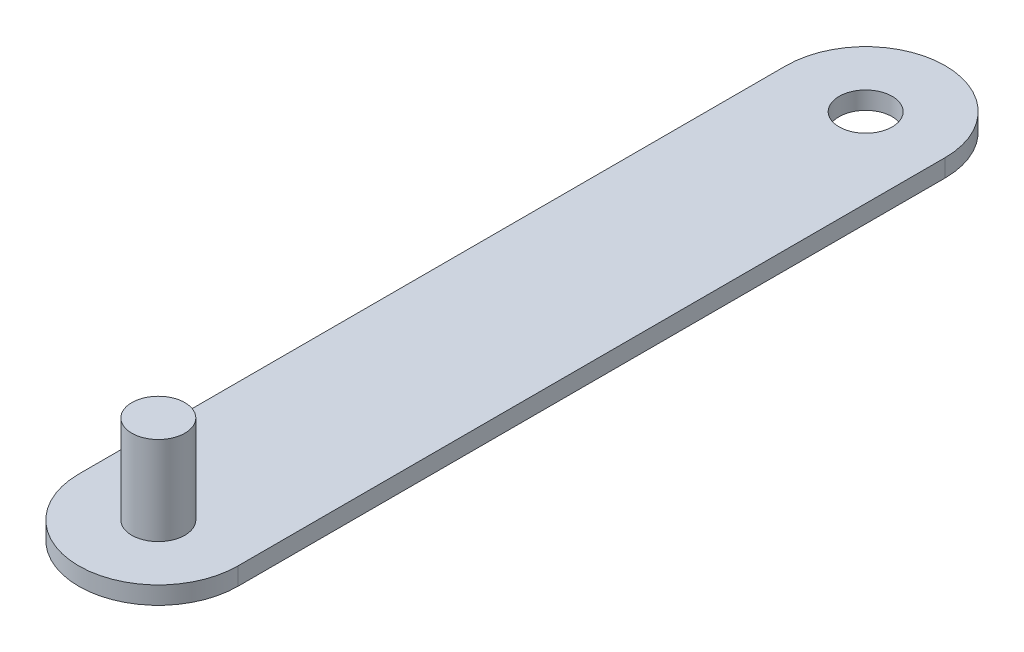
ISO-10303-21;
HEADER;
FILE_DESCRIPTION(('STEP AP214'),'2;1');
FILE_NAME('part.step','',(''),(''),'','','');
FILE_SCHEMA(('AUTOMOTIVE_DESIGN { 1 0 10303 214 1 1 1 1 }'));
ENDSEC;
DATA;
#1=APPLICATION_CONTEXT('core data for automotive mechanical design processes');
#2=APPLICATION_PROTOCOL_DEFINITION('international standard','automotive_design',2000,#1);
#3=PRODUCT_CONTEXT('',#1,'mechanical');
#4=PRODUCT('Part','Part','',(#3));
#5=PRODUCT_RELATED_PRODUCT_CATEGORY('part','',(#4));
#6=PRODUCT_DEFINITION_FORMATION('','',#4);
#7=PRODUCT_DEFINITION_CONTEXT('part definition',#1,'design');
#8=PRODUCT_DEFINITION('design','',#6,#7);
#9=PRODUCT_DEFINITION_SHAPE('','',#8);
#10=(LENGTH_UNIT() NAMED_UNIT(*) SI_UNIT(.MILLI.,.METRE.));
#11=(NAMED_UNIT(*) PLANE_ANGLE_UNIT() SI_UNIT($,.RADIAN.));
#12=(NAMED_UNIT(*) SI_UNIT($,.STERADIAN.) SOLID_ANGLE_UNIT());
#13=UNCERTAINTY_MEASURE_WITH_UNIT(LENGTH_MEASURE(1.E-05),#10,'distance_accuracy_value','');
#14=(GEOMETRIC_REPRESENTATION_CONTEXT(3) GLOBAL_UNCERTAINTY_ASSIGNED_CONTEXT((#13)) GLOBAL_UNIT_ASSIGNED_CONTEXT((#10,
#11,#12)) REPRESENTATION_CONTEXT('',''));
#15=CARTESIAN_POINT('',(0.,0.,0.));
#16=DIRECTION('',(0.,0.,1.));
#17=DIRECTION('',(1.,0.,0.));
#18=AXIS2_PLACEMENT_3D('',#15,#16,#17);
#19=CARTESIAN_POINT('',(-225.,50.,0.));
#20=DIRECTION('',(-1.,0.,0.));
#21=DIRECTION('',(0.,0.,1.));
#22=AXIS2_PLACEMENT_3D('',#19,#20,#21);
#23=PLANE('',#22);
#24=DIRECTION('',(0.,0.,-1.));
#25=VECTOR('',#24,1.);
#26=CARTESIAN_POINT('',(-225.,0.,0.));
#27=LINE('',#26,#25);
#28=CARTESIAN_POINT('',(-225.,0.,1000.));
#29=VERTEX_POINT('',#28);
#30=CARTESIAN_POINT('',(-225.,0.,-1000.));
#31=VERTEX_POINT('',#30);
#32=EDGE_CURVE('E112',#29,#31,#27,.T.);
#33=ORIENTED_EDGE('',*,*,#32,.F.);
#34=DIRECTION('',(0.,-1.,0.));
#35=VECTOR('',#34,1.);
#36=CARTESIAN_POINT('',(-225.,50.,1000.));
#37=LINE('',#36,#35);
#38=CARTESIAN_POINT('',(-225.,50.,1000.));
#39=VERTEX_POINT('',#38);
#40=EDGE_CURVE('E11',#39,#29,#37,.T.);
#41=ORIENTED_EDGE('',*,*,#40,.F.);
#42=DIRECTION('',(0.,0.,-1.));
#43=VECTOR('',#42,1.);
#44=CARTESIAN_POINT('',(-225.,50.,0.));
#45=LINE('',#44,#43);
#46=CARTESIAN_POINT('',(-225.,50.,-1000.));
#47=VERTEX_POINT('',#46);
#48=EDGE_CURVE('E102',#39,#47,#45,.T.);
#49=ORIENTED_EDGE('',*,*,#48,.T.);
#50=DIRECTION('',(0.,-1.,0.));
#51=VECTOR('',#50,1.);
#52=CARTESIAN_POINT('',(-225.,50.,-1000.));
#53=LINE('',#52,#51);
#54=EDGE_CURVE('E80',#47,#31,#53,.T.);
#55=ORIENTED_EDGE('',*,*,#54,.T.);
#56=EDGE_LOOP('',(#33,#41,#49,#55));
#57=FACE_BOUND('',#56,.T.);
#58=ADVANCED_FACE('F40',(#57),#23,.T.);
#59=CARTESIAN_POINT('',(0.,50.,1000.));
#60=DIRECTION('',(0.,-1.,0.));
#61=DIRECTION('',(0.,0.,-1.));
#62=AXIS2_PLACEMENT_3D('',#59,#60,#61);
#63=CYLINDRICAL_SURFACE('',#62,225.);
#64=CARTESIAN_POINT('',(0.,0.,1000.));
#65=DIRECTION('',(0.,1.,0.));
#66=DIRECTION('',(0.,0.,1.));
#67=AXIS2_PLACEMENT_3D('',#64,#65,#66);
#68=CIRCLE('',#67,225.);
#69=CARTESIAN_POINT('',(225.,0.,1000.));
#70=VERTEX_POINT('',#69);
#71=EDGE_CURVE('E93',#70,#29,#68,.F.);
#72=ORIENTED_EDGE('',*,*,#71,.F.);
#73=DIRECTION('',(0.,-1.,0.));
#74=VECTOR('',#73,1.);
#75=CARTESIAN_POINT('',(225.,50.,1000.));
#76=LINE('',#75,#74);
#77=CARTESIAN_POINT('',(225.,50.,1000.));
#78=VERTEX_POINT('',#77);
#79=EDGE_CURVE('E50',#78,#70,#76,.T.);
#80=ORIENTED_EDGE('',*,*,#79,.F.);
#81=CARTESIAN_POINT('',(0.,50.,1000.));
#82=DIRECTION('',(0.,1.,0.));
#83=DIRECTION('',(0.,0.,1.));
#84=AXIS2_PLACEMENT_3D('',#81,#82,#83);
#85=CIRCLE('',#84,225.);
#86=EDGE_CURVE('E91',#78,#39,#85,.F.);
#87=ORIENTED_EDGE('',*,*,#86,.T.);
#88=ORIENTED_EDGE('',*,*,#40,.T.);
#89=EDGE_LOOP('',(#72,#80,#87,#88));
#90=FACE_BOUND('',#89,.T.);
#91=ADVANCED_FACE('F89',(#90),#63,.T.);
#92=CARTESIAN_POINT('',(225.,50.,0.));
#93=DIRECTION('',(-1.,0.,0.));
#94=DIRECTION('',(0.,0.,1.));
#95=AXIS2_PLACEMENT_3D('',#92,#93,#94);
#96=PLANE('',#95);
#97=DIRECTION('',(0.,0.,-1.));
#98=VECTOR('',#97,1.);
#99=CARTESIAN_POINT('',(225.,0.,0.));
#100=LINE('',#99,#98);
#101=CARTESIAN_POINT('',(225.,0.,-1000.));
#102=VERTEX_POINT('',#101);
#103=EDGE_CURVE('E73',#70,#102,#100,.T.);
#104=ORIENTED_EDGE('',*,*,#103,.T.);
#105=DIRECTION('',(0.,-1.,0.));
#106=VECTOR('',#105,1.);
#107=CARTESIAN_POINT('',(225.,50.,-1000.));
#108=LINE('',#107,#106);
#109=CARTESIAN_POINT('',(225.,50.,-1000.));
#110=VERTEX_POINT('',#109);
#111=EDGE_CURVE('E95',#110,#102,#108,.T.);
#112=ORIENTED_EDGE('',*,*,#111,.F.);
#113=DIRECTION('',(0.,0.,-1.));
#114=VECTOR('',#113,1.);
#115=CARTESIAN_POINT('',(225.,50.,0.));
#116=LINE('',#115,#114);
#117=EDGE_CURVE('E97',#78,#110,#116,.T.);
#118=ORIENTED_EDGE('',*,*,#117,.F.);
#119=ORIENTED_EDGE('',*,*,#79,.T.);
#120=EDGE_LOOP('',(#104,#112,#118,#119));
#121=FACE_BOUND('',#120,.T.);
#122=ADVANCED_FACE('F98',(#121),#96,.F.);
#123=CARTESIAN_POINT('',(0.,50.,-1000.));
#124=DIRECTION('',(0.,-1.,0.));
#125=DIRECTION('',(0.,0.,-1.));
#126=AXIS2_PLACEMENT_3D('',#123,#124,#125);
#127=CYLINDRICAL_SURFACE('',#126,225.);
#128=CARTESIAN_POINT('',(0.,0.,-1000.));
#129=DIRECTION('',(0.,1.,0.));
#130=DIRECTION('',(0.,0.,1.));
#131=AXIS2_PLACEMENT_3D('',#128,#129,#130);
#132=CIRCLE('',#131,225.);
#133=EDGE_CURVE('E106',#102,#31,#132,.T.);
#134=ORIENTED_EDGE('',*,*,#133,.T.);
#135=ORIENTED_EDGE('',*,*,#54,.F.);
#136=CARTESIAN_POINT('',(0.,50.,-1000.));
#137=DIRECTION('',(0.,1.,0.));
#138=DIRECTION('',(0.,0.,1.));
#139=AXIS2_PLACEMENT_3D('',#136,#137,#138);
#140=CIRCLE('',#139,225.);
#141=EDGE_CURVE('E58',#110,#47,#140,.T.);
#142=ORIENTED_EDGE('',*,*,#141,.F.);
#143=ORIENTED_EDGE('',*,*,#111,.T.);
#144=EDGE_LOOP('',(#134,#135,#142,#143));
#145=FACE_BOUND('',#144,.T.);
#146=ADVANCED_FACE('F128',(#145),#127,.T.);
#147=CARTESIAN_POINT('',(0.,50.,0.));
#148=DIRECTION('',(0.,1.,0.));
#149=DIRECTION('',(0.,0.,1.));
#150=AXIS2_PLACEMENT_3D('',#147,#148,#149);
#151=PLANE('',#150);
#152=CARTESIAN_POINT('',(0.,50.,-1000.));
#153=DIRECTION('',(0.,1.,0.));
#154=DIRECTION('',(0.,0.,1.));
#155=AXIS2_PLACEMENT_3D('',#152,#153,#154);
#156=CIRCLE('',#155,75.);
#157=CARTESIAN_POINT('',(0.,50.,-925.));
#158=VERTEX_POINT('',#157);
#159=EDGE_CURVE('E164',#158,#158,#156,.T.);
#160=ORIENTED_EDGE('',*,*,#159,.F.);
#161=EDGE_LOOP('',(#160));
#162=FACE_BOUND('',#161,.T.);
#163=CARTESIAN_POINT('',(0.,50.,1000.));
#164=DIRECTION('',(0.,1.,0.));
#165=DIRECTION('',(0.,0.,1.));
#166=AXIS2_PLACEMENT_3D('',#163,#164,#165);
#167=CIRCLE('',#166,75.);
#168=CARTESIAN_POINT('',(0.,50.,1075.));
#169=VERTEX_POINT('',#168);
#170=EDGE_CURVE('E168',#169,#169,#167,.T.);
#171=ORIENTED_EDGE('',*,*,#170,.F.);
#172=EDGE_LOOP('',(#171));
#173=FACE_BOUND('',#172,.T.);
#174=ORIENTED_EDGE('',*,*,#48,.F.);
#175=ORIENTED_EDGE('',*,*,#86,.F.);
#176=ORIENTED_EDGE('',*,*,#117,.T.);
#177=ORIENTED_EDGE('',*,*,#141,.T.);
#178=EDGE_LOOP('',(#174,#175,#176,#177));
#179=FACE_BOUND('',#178,.T.);
#180=ADVANCED_FACE('F101',(#162,#173,#179),#151,.T.);
#181=CARTESIAN_POINT('',(0.,0.,0.));
#182=DIRECTION('',(0.,1.,0.));
#183=DIRECTION('',(0.,0.,1.));
#184=AXIS2_PLACEMENT_3D('',#181,#182,#183);
#185=PLANE('',#184);
#186=CARTESIAN_POINT('',(0.,0.,-1000.));
#187=DIRECTION('',(0.,1.,0.));
#188=DIRECTION('',(0.,0.,1.));
#189=AXIS2_PLACEMENT_3D('',#186,#187,#188);
#190=CIRCLE('',#189,75.);
#191=CARTESIAN_POINT('',(0.,0.,-925.));
#192=VERTEX_POINT('',#191);
#193=EDGE_CURVE('E43',#192,#192,#190,.T.);
#194=ORIENTED_EDGE('',*,*,#193,.T.);
#195=EDGE_LOOP('',(#194));
#196=FACE_BOUND('',#195,.T.);
#197=ORIENTED_EDGE('',*,*,#32,.T.);
#198=ORIENTED_EDGE('',*,*,#133,.F.);
#199=ORIENTED_EDGE('',*,*,#103,.F.);
#200=ORIENTED_EDGE('',*,*,#71,.T.);
#201=EDGE_LOOP('',(#197,#198,#199,#200));
#202=FACE_BOUND('',#201,.T.);
#203=ADVANCED_FACE('F130',(#196,#202),#185,.F.);
#204=CARTESIAN_POINT('',(0.,300.,1000.));
#205=DIRECTION('',(0.,-1.,0.));
#206=DIRECTION('',(0.,0.,-1.));
#207=AXIS2_PLACEMENT_3D('',#204,#205,#206);
#208=CYLINDRICAL_SURFACE('',#207,75.);
#209=CARTESIAN_POINT('',(0.,300.,1000.));
#210=DIRECTION('',(0.,1.,0.));
#211=DIRECTION('',(0.,0.,1.));
#212=AXIS2_PLACEMENT_3D('',#209,#210,#211);
#213=CIRCLE('',#212,75.);
#214=CARTESIAN_POINT('',(0.,300.,1075.));
#215=VERTEX_POINT('',#214);
#216=EDGE_CURVE('E116',#215,#215,#213,.T.);
#217=ORIENTED_EDGE('',*,*,#216,.F.);
#218=EDGE_LOOP('',(#217));
#219=FACE_BOUND('',#218,.T.);
#220=ORIENTED_EDGE('',*,*,#170,.T.);
#221=EDGE_LOOP('',(#220));
#222=FACE_BOUND('',#221,.T.);
#223=ADVANCED_FACE('F144',(#219,#222),#208,.T.);
#224=CARTESIAN_POINT('',(0.,300.,0.));
#225=DIRECTION('',(0.,1.,0.));
#226=DIRECTION('',(0.,0.,1.));
#227=AXIS2_PLACEMENT_3D('',#224,#225,#226);
#228=PLANE('',#227);
#229=ORIENTED_EDGE('',*,*,#216,.T.);
#230=EDGE_LOOP('',(#229));
#231=FACE_BOUND('',#230,.T.);
#232=ADVANCED_FACE('F151',(#231),#228,.T.);
#233=CARTESIAN_POINT('',(0.,-200.,-1000.));
#234=DIRECTION('',(0.,1.,0.));
#235=DIRECTION('',(0.,0.,1.));
#236=AXIS2_PLACEMENT_3D('',#233,#234,#235);
#237=CYLINDRICAL_SURFACE('',#236,75.);
#238=ORIENTED_EDGE('',*,*,#159,.T.);
#239=EDGE_LOOP('',(#238));
#240=FACE_BOUND('',#239,.T.);
#241=ORIENTED_EDGE('',*,*,#193,.F.);
#242=EDGE_LOOP('',(#241));
#243=FACE_BOUND('',#242,.T.);
#244=ADVANCED_FACE('F155',(#240,#243),#237,.F.);
#245=CLOSED_SHELL('',(#58,#91,#122,#146,#180,#203,#223,#232,#244));
#246=MANIFOLD_SOLID_BREP('B2',#245);
#247=ADVANCED_BREP_SHAPE_REPRESENTATION('',(#18,#246),#14);
#248=SHAPE_DEFINITION_REPRESENTATION(#9,#247);
ENDSEC;
END-ISO-10303-21;
